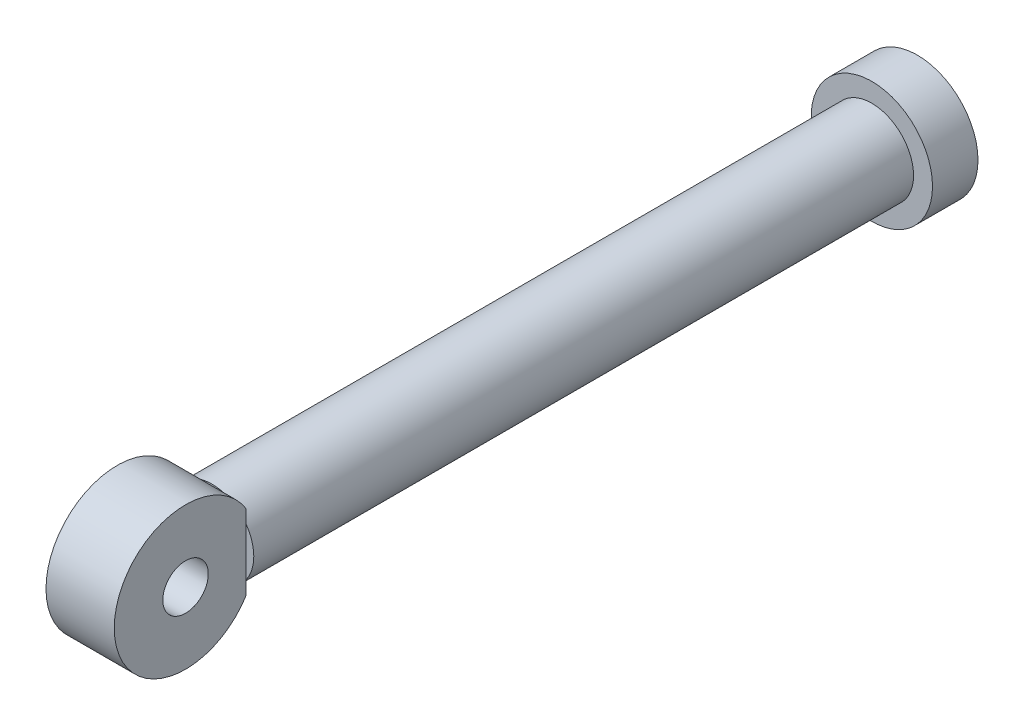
from build123d import *

# Parameters (mm, degrees)
SKETCH_1_R      = 40
EXTRUDE_1_DEPTH = 30
SKETCH_2_R      = 27.5
EXTRUDE_2_DEPTH = 435
SKETCH_3_R      = 15
EXTRUDE_3_DEPTH = 22.5


with BuildPart() as part:
    # Sketch 1 → Extrude 1 (new body)
    with BuildSketch(Plane.XY):
        Circle(SKETCH_1_R)
    extrude(amount=EXTRUDE_1_DEPTH)

    # Sketch 2 → Extrude 2 (add)
    with BuildSketch(Plane.XY.offset(30)):
        with Locations(Location((0, 0, 0), (0, 0, 180))):
            Circle(SKETCH_2_R)
    extrude(amount=EXTRUDE_2_DEPTH)

    # Sketch 3 → Extrude 3 (add, symmetric)
    with BuildSketch(Plane(origin=(0, 0, 0), x_dir=(0, 0, -1), z_dir=(1, 0, 0))):
        with BuildLine():
            Line((-465, 24.677925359), (-465, -24.677925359))
            ThreePointArc((-465, -24.677925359), (-552, 0), (-465, 24.677925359))
        make_face()
        with Locations(Location((-505, 0, 0), (0, 0, 180))):
            Circle(SKETCH_3_R, mode=Mode.SUBTRACT)
    extrude(amount=EXTRUDE_3_DEPTH, both=True)


solid = part.part
